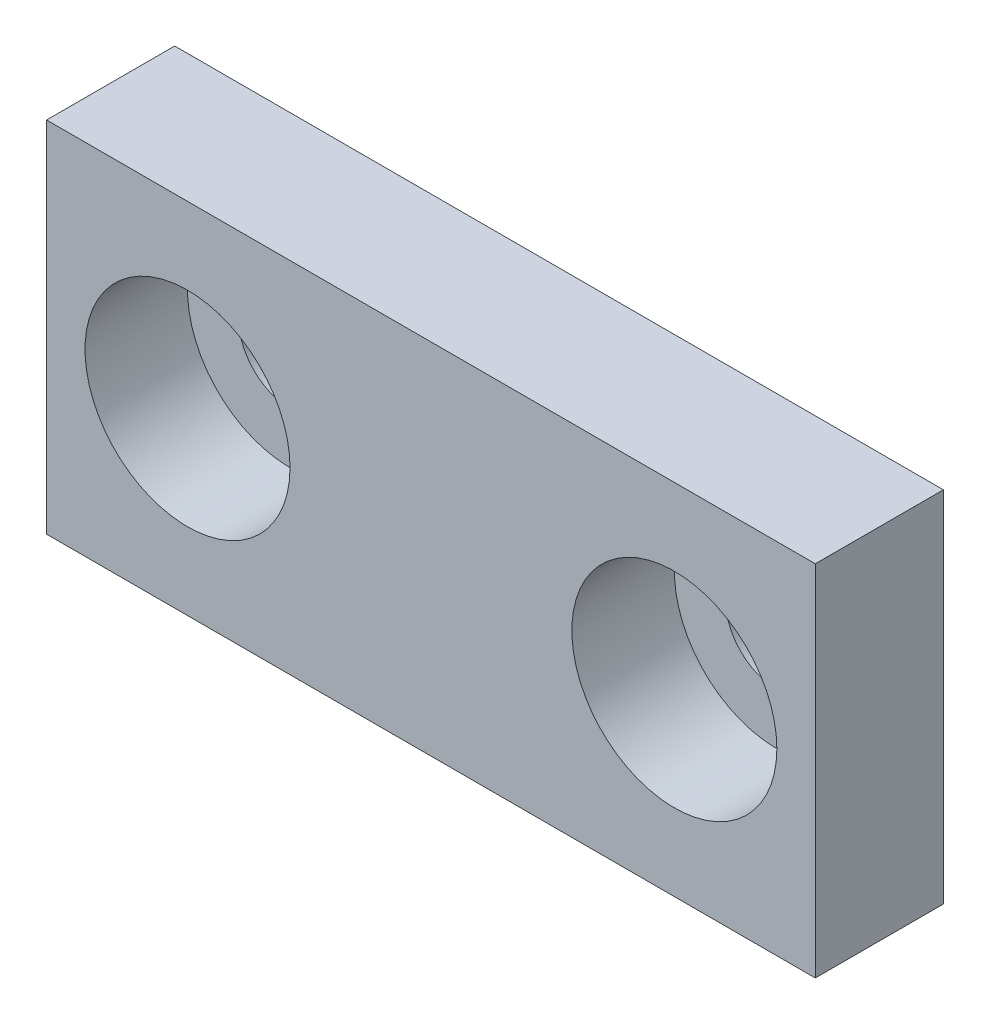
ISO-10303-21;
HEADER;
FILE_DESCRIPTION(('STEP AP214'),'2;1');
FILE_NAME('part.step','',(''),(''),'','','');
FILE_SCHEMA(('AUTOMOTIVE_DESIGN { 1 0 10303 214 1 1 1 1 }'));
ENDSEC;
DATA;
#1=APPLICATION_CONTEXT('core data for automotive mechanical design processes');
#2=APPLICATION_PROTOCOL_DEFINITION('international standard','automotive_design',2000,#1);
#3=PRODUCT_CONTEXT('',#1,'mechanical');
#4=PRODUCT('Part','Part','',(#3));
#5=PRODUCT_RELATED_PRODUCT_CATEGORY('part','',(#4));
#6=PRODUCT_DEFINITION_FORMATION('','',#4);
#7=PRODUCT_DEFINITION_CONTEXT('part definition',#1,'design');
#8=PRODUCT_DEFINITION('design','',#6,#7);
#9=PRODUCT_DEFINITION_SHAPE('','',#8);
#10=(LENGTH_UNIT() NAMED_UNIT(*) SI_UNIT(.MILLI.,.METRE.));
#11=(NAMED_UNIT(*) PLANE_ANGLE_UNIT() SI_UNIT($,.RADIAN.));
#12=(NAMED_UNIT(*) SI_UNIT($,.STERADIAN.) SOLID_ANGLE_UNIT());
#13=UNCERTAINTY_MEASURE_WITH_UNIT(LENGTH_MEASURE(1.E-05),#10,'distance_accuracy_value','');
#14=(GEOMETRIC_REPRESENTATION_CONTEXT(3) GLOBAL_UNCERTAINTY_ASSIGNED_CONTEXT((#13)) GLOBAL_UNIT_ASSIGNED_CONTEXT((#10,
#11,#12)) REPRESENTATION_CONTEXT('',''));
#15=CARTESIAN_POINT('',(0.,0.,0.));
#16=DIRECTION('',(0.,0.,1.));
#17=DIRECTION('',(1.,0.,0.));
#18=AXIS2_PLACEMENT_3D('',#15,#16,#17);
#19=CARTESIAN_POINT('',(15.,7.,5.));
#20=DIRECTION('',(-1.,0.,0.));
#21=DIRECTION('',(0.,0.,1.));
#22=AXIS2_PLACEMENT_3D('',#19,#20,#21);
#23=PLANE('',#22);
#24=DIRECTION('',(0.,1.,0.));
#25=VECTOR('',#24,1.);
#26=CARTESIAN_POINT('',(15.,7.,0.));
#27=LINE('',#26,#25);
#28=CARTESIAN_POINT('',(15.,-7.,0.));
#29=VERTEX_POINT('',#28);
#30=CARTESIAN_POINT('',(15.,7.,0.));
#31=VERTEX_POINT('',#30);
#32=EDGE_CURVE('E96',#29,#31,#27,.T.);
#33=ORIENTED_EDGE('',*,*,#32,.T.);
#34=DIRECTION('',(0.,0.,-1.));
#35=VECTOR('',#34,1.);
#36=CARTESIAN_POINT('',(15.,7.,5.));
#37=LINE('',#36,#35);
#38=CARTESIAN_POINT('',(15.,7.,5.));
#39=VERTEX_POINT('',#38);
#40=EDGE_CURVE('E11',#39,#31,#37,.T.);
#41=ORIENTED_EDGE('',*,*,#40,.F.);
#42=DIRECTION('',(0.,1.,0.));
#43=VECTOR('',#42,1.);
#44=CARTESIAN_POINT('',(15.,7.,5.));
#45=LINE('',#44,#43);
#46=CARTESIAN_POINT('',(15.,-7.,5.));
#47=VERTEX_POINT('',#46);
#48=EDGE_CURVE('E84',#47,#39,#45,.T.);
#49=ORIENTED_EDGE('',*,*,#48,.F.);
#50=DIRECTION('',(0.,0.,-1.));
#51=VECTOR('',#50,1.);
#52=CARTESIAN_POINT('',(15.,-7.,5.));
#53=LINE('',#52,#51);
#54=EDGE_CURVE('E92',#47,#29,#53,.T.);
#55=ORIENTED_EDGE('',*,*,#54,.T.);
#56=EDGE_LOOP('',(#33,#41,#49,#55));
#57=FACE_BOUND('',#56,.T.);
#58=ADVANCED_FACE('F33',(#57),#23,.F.);
#59=CARTESIAN_POINT('',(-15.,7.,5.));
#60=DIRECTION('',(0.,-1.,0.));
#61=DIRECTION('',(0.,0.,-1.));
#62=AXIS2_PLACEMENT_3D('',#59,#60,#61);
#63=PLANE('',#62);
#64=DIRECTION('',(-1.,0.,0.));
#65=VECTOR('',#64,1.);
#66=CARTESIAN_POINT('',(-15.,7.,0.));
#67=LINE('',#66,#65);
#68=CARTESIAN_POINT('',(-15.,7.,0.));
#69=VERTEX_POINT('',#68);
#70=EDGE_CURVE('E88',#31,#69,#67,.T.);
#71=ORIENTED_EDGE('',*,*,#70,.T.);
#72=DIRECTION('',(0.,0.,-1.));
#73=VECTOR('',#72,1.);
#74=CARTESIAN_POINT('',(-15.,7.,5.));
#75=LINE('',#74,#73);
#76=CARTESIAN_POINT('',(-15.,7.,5.));
#77=VERTEX_POINT('',#76);
#78=EDGE_CURVE('E41',#77,#69,#75,.T.);
#79=ORIENTED_EDGE('',*,*,#78,.F.);
#80=DIRECTION('',(-1.,0.,0.));
#81=VECTOR('',#80,1.);
#82=CARTESIAN_POINT('',(-15.,7.,5.));
#83=LINE('',#82,#81);
#84=EDGE_CURVE('E79',#39,#77,#83,.T.);
#85=ORIENTED_EDGE('',*,*,#84,.F.);
#86=ORIENTED_EDGE('',*,*,#40,.T.);
#87=EDGE_LOOP('',(#71,#79,#85,#86));
#88=FACE_BOUND('',#87,.T.);
#89=ADVANCED_FACE('F87',(#88),#63,.F.);
#90=CARTESIAN_POINT('',(-15.,7.,5.));
#91=DIRECTION('',(1.,0.,0.));
#92=DIRECTION('',(0.,1.,0.));
#93=AXIS2_PLACEMENT_3D('',#90,#91,#92);
#94=PLANE('',#93);
#95=DIRECTION('',(0.,-1.,0.));
#96=VECTOR('',#95,1.);
#97=CARTESIAN_POINT('',(-15.,7.,0.));
#98=LINE('',#97,#96);
#99=CARTESIAN_POINT('',(-15.,-7.,0.));
#100=VERTEX_POINT('',#99);
#101=EDGE_CURVE('E66',#69,#100,#98,.T.);
#102=ORIENTED_EDGE('',*,*,#101,.T.);
#103=DIRECTION('',(0.,0.,-1.));
#104=VECTOR('',#103,1.);
#105=CARTESIAN_POINT('',(-15.,-7.,5.));
#106=LINE('',#105,#104);
#107=CARTESIAN_POINT('',(-15.,-7.,5.));
#108=VERTEX_POINT('',#107);
#109=EDGE_CURVE('E89',#108,#100,#106,.T.);
#110=ORIENTED_EDGE('',*,*,#109,.F.);
#111=DIRECTION('',(0.,-1.,0.));
#112=VECTOR('',#111,1.);
#113=CARTESIAN_POINT('',(-15.,7.,5.));
#114=LINE('',#113,#112);
#115=EDGE_CURVE('E82',#77,#108,#114,.T.);
#116=ORIENTED_EDGE('',*,*,#115,.F.);
#117=ORIENTED_EDGE('',*,*,#78,.T.);
#118=EDGE_LOOP('',(#102,#110,#116,#117));
#119=FACE_BOUND('',#118,.T.);
#120=ADVANCED_FACE('F90',(#119),#94,.F.);
#121=CARTESIAN_POINT('',(-15.,-7.,5.));
#122=DIRECTION('',(0.,1.,0.));
#123=DIRECTION('',(0.,0.,1.));
#124=AXIS2_PLACEMENT_3D('',#121,#122,#123);
#125=PLANE('',#124);
#126=DIRECTION('',(1.,0.,0.));
#127=VECTOR('',#126,1.);
#128=CARTESIAN_POINT('',(-15.,-7.,0.));
#129=LINE('',#128,#127);
#130=EDGE_CURVE('E72',#100,#29,#129,.T.);
#131=ORIENTED_EDGE('',*,*,#130,.T.);
#132=ORIENTED_EDGE('',*,*,#54,.F.);
#133=DIRECTION('',(1.,0.,0.));
#134=VECTOR('',#133,1.);
#135=CARTESIAN_POINT('',(-15.,-7.,5.));
#136=LINE('',#135,#134);
#137=EDGE_CURVE('E49',#108,#47,#136,.T.);
#138=ORIENTED_EDGE('',*,*,#137,.F.);
#139=ORIENTED_EDGE('',*,*,#109,.T.);
#140=EDGE_LOOP('',(#131,#132,#138,#139));
#141=FACE_BOUND('',#140,.T.);
#142=ADVANCED_FACE('F104',(#141),#125,.F.);
#143=CARTESIAN_POINT('',(0.,0.,5.));
#144=DIRECTION('',(0.,0.,1.));
#145=DIRECTION('',(1.,0.,0.));
#146=AXIS2_PLACEMENT_3D('',#143,#144,#145);
#147=PLANE('',#146);
#148=CARTESIAN_POINT('',(-9.5,0.,5.));
#149=DIRECTION('',(0.,0.,1.));
#150=DIRECTION('',(1.,0.,0.));
#151=AXIS2_PLACEMENT_3D('',#148,#149,#150);
#152=CIRCLE('',#151,4.);
#153=CARTESIAN_POINT('',(-5.5,0.,5.));
#154=VERTEX_POINT('',#153);
#155=EDGE_CURVE('E116',#154,#154,#152,.T.);
#156=ORIENTED_EDGE('',*,*,#155,.F.);
#157=EDGE_LOOP('',(#156));
#158=FACE_BOUND('',#157,.T.);
#159=CARTESIAN_POINT('',(9.5,0.,5.));
#160=DIRECTION('',(0.,0.,1.));
#161=DIRECTION('',(1.,0.,0.));
#162=AXIS2_PLACEMENT_3D('',#159,#160,#161);
#163=CIRCLE('',#162,4.);
#164=CARTESIAN_POINT('',(13.5,0.,5.));
#165=VERTEX_POINT('',#164);
#166=EDGE_CURVE('E110',#165,#165,#163,.T.);
#167=ORIENTED_EDGE('',*,*,#166,.F.);
#168=EDGE_LOOP('',(#167));
#169=FACE_BOUND('',#168,.T.);
#170=ORIENTED_EDGE('',*,*,#48,.T.);
#171=ORIENTED_EDGE('',*,*,#84,.T.);
#172=ORIENTED_EDGE('',*,*,#115,.T.);
#173=ORIENTED_EDGE('',*,*,#137,.T.);
#174=EDGE_LOOP('',(#170,#171,#172,#173));
#175=FACE_BOUND('',#174,.T.);
#176=ADVANCED_FACE('F80',(#158,#169,#175),#147,.T.);
#177=CARTESIAN_POINT('',(0.,0.,0.));
#178=DIRECTION('',(0.,0.,1.));
#179=DIRECTION('',(1.,0.,0.));
#180=AXIS2_PLACEMENT_3D('',#177,#178,#179);
#181=PLANE('',#180);
#182=CARTESIAN_POINT('',(9.5,0.,0.));
#183=DIRECTION('',(0.,0.,1.));
#184=DIRECTION('',(1.,0.,0.));
#185=AXIS2_PLACEMENT_3D('',#182,#183,#184);
#186=CIRCLE('',#185,2.);
#187=CARTESIAN_POINT('',(11.5,0.,0.));
#188=VERTEX_POINT('',#187);
#189=EDGE_CURVE('E125',#188,#188,#186,.T.);
#190=ORIENTED_EDGE('',*,*,#189,.T.);
#191=EDGE_LOOP('',(#190));
#192=FACE_BOUND('',#191,.T.);
#193=CARTESIAN_POINT('',(-9.5,0.,0.));
#194=DIRECTION('',(0.,0.,1.));
#195=DIRECTION('',(1.,0.,0.));
#196=AXIS2_PLACEMENT_3D('',#193,#194,#195);
#197=CIRCLE('',#196,2.);
#198=CARTESIAN_POINT('',(-7.5,0.,0.));
#199=VERTEX_POINT('',#198);
#200=EDGE_CURVE('E119',#199,#199,#197,.T.);
#201=ORIENTED_EDGE('',*,*,#200,.T.);
#202=EDGE_LOOP('',(#201));
#203=FACE_BOUND('',#202,.T.);
#204=ORIENTED_EDGE('',*,*,#32,.F.);
#205=ORIENTED_EDGE('',*,*,#130,.F.);
#206=ORIENTED_EDGE('',*,*,#101,.F.);
#207=ORIENTED_EDGE('',*,*,#70,.F.);
#208=EDGE_LOOP('',(#204,#205,#206,#207));
#209=FACE_BOUND('',#208,.T.);
#210=ADVANCED_FACE('F107',(#192,#203,#209),#181,.F.);
#211=CARTESIAN_POINT('',(9.5,0.,1.));
#212=DIRECTION('',(0.,0.,1.));
#213=DIRECTION('',(1.,0.,0.));
#214=AXIS2_PLACEMENT_3D('',#211,#212,#213);
#215=CYLINDRICAL_SURFACE('',#214,4.);
#216=CARTESIAN_POINT('',(9.5,0.,1.));
#217=DIRECTION('',(0.,0.,1.));
#218=DIRECTION('',(1.,0.,0.));
#219=AXIS2_PLACEMENT_3D('',#216,#217,#218);
#220=CIRCLE('',#219,4.);
#221=CARTESIAN_POINT('',(13.5,0.,1.));
#222=VERTEX_POINT('',#221);
#223=EDGE_CURVE('E99',#222,#222,#220,.T.);
#224=ORIENTED_EDGE('',*,*,#223,.F.);
#225=EDGE_LOOP('',(#224));
#226=FACE_BOUND('',#225,.T.);
#227=ORIENTED_EDGE('',*,*,#166,.T.);
#228=EDGE_LOOP('',(#227));
#229=FACE_BOUND('',#228,.T.);
#230=ADVANCED_FACE('F147',(#226,#229),#215,.F.);
#231=CARTESIAN_POINT('',(9.5,0.,1.));
#232=DIRECTION('',(0.,0.,1.));
#233=DIRECTION('',(1.,0.,0.));
#234=AXIS2_PLACEMENT_3D('',#231,#232,#233);
#235=PLANE('',#234);
#236=CARTESIAN_POINT('',(9.5,0.,1.));
#237=DIRECTION('',(0.,0.,1.));
#238=DIRECTION('',(1.,0.,0.));
#239=AXIS2_PLACEMENT_3D('',#236,#237,#238);
#240=CIRCLE('',#239,2.);
#241=CARTESIAN_POINT('',(11.5,0.,1.));
#242=VERTEX_POINT('',#241);
#243=EDGE_CURVE('E128',#242,#242,#240,.T.);
#244=ORIENTED_EDGE('',*,*,#243,.F.);
#245=EDGE_LOOP('',(#244));
#246=FACE_BOUND('',#245,.T.);
#247=ORIENTED_EDGE('',*,*,#223,.T.);
#248=EDGE_LOOP('',(#247));
#249=FACE_BOUND('',#248,.T.);
#250=ADVANCED_FACE('F143',(#246,#249),#235,.T.);
#251=CARTESIAN_POINT('',(-9.5,0.,1.));
#252=DIRECTION('',(0.,0.,1.));
#253=DIRECTION('',(1.,0.,0.));
#254=AXIS2_PLACEMENT_3D('',#251,#252,#253);
#255=CYLINDRICAL_SURFACE('',#254,4.);
#256=CARTESIAN_POINT('',(-9.5,0.,1.));
#257=DIRECTION('',(0.,0.,1.));
#258=DIRECTION('',(1.,0.,0.));
#259=AXIS2_PLACEMENT_3D('',#256,#257,#258);
#260=CIRCLE('',#259,4.);
#261=CARTESIAN_POINT('',(-5.5,0.,1.));
#262=VERTEX_POINT('',#261);
#263=EDGE_CURVE('E113',#262,#262,#260,.T.);
#264=ORIENTED_EDGE('',*,*,#263,.F.);
#265=EDGE_LOOP('',(#264));
#266=FACE_BOUND('',#265,.T.);
#267=ORIENTED_EDGE('',*,*,#155,.T.);
#268=EDGE_LOOP('',(#267));
#269=FACE_BOUND('',#268,.T.);
#270=ADVANCED_FACE('F146',(#266,#269),#255,.F.);
#271=CARTESIAN_POINT('',(-9.5,0.,1.));
#272=DIRECTION('',(0.,0.,1.));
#273=DIRECTION('',(1.,0.,0.));
#274=AXIS2_PLACEMENT_3D('',#271,#272,#273);
#275=PLANE('',#274);
#276=CARTESIAN_POINT('',(-9.5,0.,1.));
#277=DIRECTION('',(0.,0.,1.));
#278=DIRECTION('',(1.,0.,0.));
#279=AXIS2_PLACEMENT_3D('',#276,#277,#278);
#280=CIRCLE('',#279,2.);
#281=CARTESIAN_POINT('',(-7.5,0.,1.));
#282=VERTEX_POINT('',#281);
#283=EDGE_CURVE('E122',#282,#282,#280,.T.);
#284=ORIENTED_EDGE('',*,*,#283,.F.);
#285=EDGE_LOOP('',(#284));
#286=FACE_BOUND('',#285,.T.);
#287=ORIENTED_EDGE('',*,*,#263,.T.);
#288=EDGE_LOOP('',(#287));
#289=FACE_BOUND('',#288,.T.);
#290=ADVANCED_FACE('F201',(#286,#289),#275,.T.);
#291=CARTESIAN_POINT('',(-9.5,0.,0.));
#292=DIRECTION('',(0.,0.,1.));
#293=DIRECTION('',(1.,0.,0.));
#294=AXIS2_PLACEMENT_3D('',#291,#292,#293);
#295=CYLINDRICAL_SURFACE('',#294,2.);
#296=ORIENTED_EDGE('',*,*,#200,.F.);
#297=EDGE_LOOP('',(#296));
#298=FACE_BOUND('',#297,.T.);
#299=ORIENTED_EDGE('',*,*,#283,.T.);
#300=EDGE_LOOP('',(#299));
#301=FACE_BOUND('',#300,.T.);
#302=ADVANCED_FACE('F139',(#298,#301),#295,.F.);
#303=CARTESIAN_POINT('',(9.5,0.,0.));
#304=DIRECTION('',(0.,0.,1.));
#305=DIRECTION('',(1.,0.,0.));
#306=AXIS2_PLACEMENT_3D('',#303,#304,#305);
#307=CYLINDRICAL_SURFACE('',#306,2.);
#308=ORIENTED_EDGE('',*,*,#189,.F.);
#309=EDGE_LOOP('',(#308));
#310=FACE_BOUND('',#309,.T.);
#311=ORIENTED_EDGE('',*,*,#243,.T.);
#312=EDGE_LOOP('',(#311));
#313=FACE_BOUND('',#312,.T.);
#314=ADVANCED_FACE('F136',(#310,#313),#307,.F.);
#315=CLOSED_SHELL('',(#58,#89,#120,#142,#176,#210,#230,#250,#270,#290,#302,#314));
#316=MANIFOLD_SOLID_BREP('B2',#315);
#317=ADVANCED_BREP_SHAPE_REPRESENTATION('',(#18,#316),#14);
#318=SHAPE_DEFINITION_REPRESENTATION(#9,#317);
ENDSEC;
END-ISO-10303-21;
